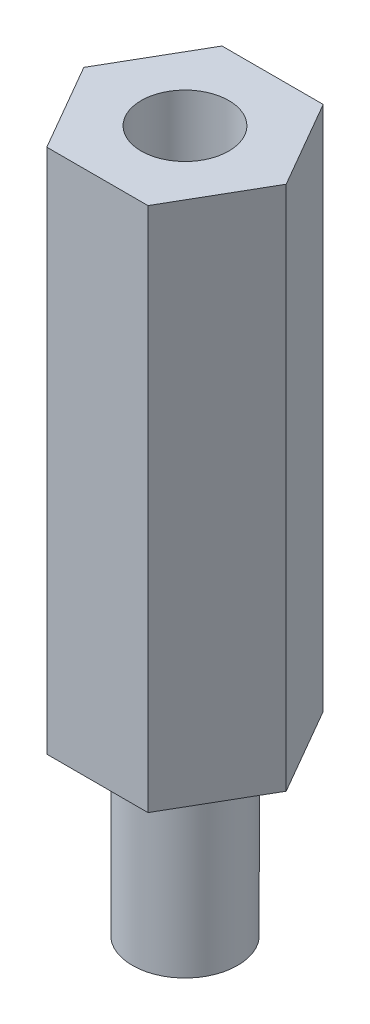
ISO-10303-21;
HEADER;
FILE_DESCRIPTION(('STEP AP214'),'2;1');
FILE_NAME('part.step','',(''),(''),'','','');
FILE_SCHEMA(('AUTOMOTIVE_DESIGN { 1 0 10303 214 1 1 1 1 }'));
ENDSEC;
DATA;
#1=APPLICATION_CONTEXT('core data for automotive mechanical design processes');
#2=APPLICATION_PROTOCOL_DEFINITION('international standard','automotive_design',2000,#1);
#3=PRODUCT_CONTEXT('',#1,'mechanical');
#4=PRODUCT('Part','Part','',(#3));
#5=PRODUCT_RELATED_PRODUCT_CATEGORY('part','',(#4));
#6=PRODUCT_DEFINITION_FORMATION('','',#4);
#7=PRODUCT_DEFINITION_CONTEXT('part definition',#1,'design');
#8=PRODUCT_DEFINITION('design','',#6,#7);
#9=PRODUCT_DEFINITION_SHAPE('','',#8);
#10=(LENGTH_UNIT() NAMED_UNIT(*) SI_UNIT(.MILLI.,.METRE.));
#11=(NAMED_UNIT(*) PLANE_ANGLE_UNIT() SI_UNIT($,.RADIAN.));
#12=(NAMED_UNIT(*) SI_UNIT($,.STERADIAN.) SOLID_ANGLE_UNIT());
#13=UNCERTAINTY_MEASURE_WITH_UNIT(LENGTH_MEASURE(1.E-05),#10,'distance_accuracy_value','');
#14=(GEOMETRIC_REPRESENTATION_CONTEXT(3) GLOBAL_UNCERTAINTY_ASSIGNED_CONTEXT((#13)) GLOBAL_UNIT_ASSIGNED_CONTEXT((#10,
#11,#12)) REPRESENTATION_CONTEXT('',''));
#15=CARTESIAN_POINT('',(0.,0.,0.));
#16=DIRECTION('',(0.,0.,1.));
#17=DIRECTION('',(1.,0.,0.));
#18=AXIS2_PLACEMENT_3D('',#15,#16,#17);
#19=CARTESIAN_POINT('',(5.77350269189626,30.,0.));
#20=DIRECTION('',(-0.866025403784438,0.,0.5));
#21=DIRECTION('',(0.5,0.,0.866025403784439));
#22=AXIS2_PLACEMENT_3D('',#19,#20,#21);
#23=PLANE('',#22);
#24=DIRECTION('',(-0.5,0.,-0.866025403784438));
#25=VECTOR('',#24,1.);
#26=CARTESIAN_POINT('',(5.77350269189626,0.,0.));
#27=LINE('',#26,#25);
#28=CARTESIAN_POINT('',(5.77350269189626,0.,0.));
#29=VERTEX_POINT('',#28);
#30=CARTESIAN_POINT('',(2.88675134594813,0.,-5.));
#31=VERTEX_POINT('',#30);
#32=EDGE_CURVE('E121',#29,#31,#27,.T.);
#33=ORIENTED_EDGE('',*,*,#32,.T.);
#34=DIRECTION('',(0.,-1.,0.));
#35=VECTOR('',#34,1.);
#36=CARTESIAN_POINT('',(2.88675134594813,30.,-5.));
#37=LINE('',#36,#35);
#38=CARTESIAN_POINT('',(2.88675134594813,30.,-5.));
#39=VERTEX_POINT('',#38);
#40=EDGE_CURVE('E44',#39,#31,#37,.T.);
#41=ORIENTED_EDGE('',*,*,#40,.F.);
#42=DIRECTION('',(-0.5,0.,-0.866025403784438));
#43=VECTOR('',#42,1.);
#44=CARTESIAN_POINT('',(5.77350269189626,30.,0.));
#45=LINE('',#44,#43);
#46=CARTESIAN_POINT('',(5.77350269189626,30.,0.));
#47=VERTEX_POINT('',#46);
#48=EDGE_CURVE('E132',#47,#39,#45,.T.);
#49=ORIENTED_EDGE('',*,*,#48,.F.);
#50=DIRECTION('',(0.,-1.,0.));
#51=VECTOR('',#50,1.);
#52=CARTESIAN_POINT('',(5.77350269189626,30.,0.));
#53=LINE('',#52,#51);
#54=EDGE_CURVE('E117',#47,#29,#53,.T.);
#55=ORIENTED_EDGE('',*,*,#54,.T.);
#56=EDGE_LOOP('',(#33,#41,#49,#55));
#57=FACE_BOUND('',#56,.T.);
#58=ADVANCED_FACE('F36',(#57),#23,.F.);
#59=CARTESIAN_POINT('',(2.88675134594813,30.,-5.));
#60=DIRECTION('',(0.,0.,1.));
#61=DIRECTION('',(1.,0.,0.));
#62=AXIS2_PLACEMENT_3D('',#59,#60,#61);
#63=PLANE('',#62);
#64=DIRECTION('',(-1.,0.,0.));
#65=VECTOR('',#64,1.);
#66=CARTESIAN_POINT('',(2.88675134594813,0.,-5.));
#67=LINE('',#66,#65);
#68=CARTESIAN_POINT('',(-2.88675134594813,0.,-5.));
#69=VERTEX_POINT('',#68);
#70=EDGE_CURVE('E124',#31,#69,#67,.T.);
#71=ORIENTED_EDGE('',*,*,#70,.T.);
#72=DIRECTION('',(0.,-1.,0.));
#73=VECTOR('',#72,1.);
#74=CARTESIAN_POINT('',(-2.88675134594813,30.,-5.));
#75=LINE('',#74,#73);
#76=CARTESIAN_POINT('',(-2.88675134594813,30.,-5.));
#77=VERTEX_POINT('',#76);
#78=EDGE_CURVE('E136',#77,#69,#75,.T.);
#79=ORIENTED_EDGE('',*,*,#78,.F.);
#80=DIRECTION('',(-1.,0.,0.));
#81=VECTOR('',#80,1.);
#82=CARTESIAN_POINT('',(2.88675134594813,30.,-5.));
#83=LINE('',#82,#81);
#84=EDGE_CURVE('E90',#39,#77,#83,.T.);
#85=ORIENTED_EDGE('',*,*,#84,.F.);
#86=ORIENTED_EDGE('',*,*,#40,.T.);
#87=EDGE_LOOP('',(#71,#79,#85,#86));
#88=FACE_BOUND('',#87,.T.);
#89=ADVANCED_FACE('F139',(#88),#63,.F.);
#90=CARTESIAN_POINT('',(-2.88675134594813,30.,-5.));
#91=DIRECTION('',(0.866025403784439,0.,0.5));
#92=DIRECTION('',(0.5,0.,-0.866025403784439));
#93=AXIS2_PLACEMENT_3D('',#90,#91,#92);
#94=PLANE('',#93);
#95=DIRECTION('',(-0.5,0.,0.866025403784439));
#96=VECTOR('',#95,1.);
#97=CARTESIAN_POINT('',(-2.88675134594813,0.,-5.));
#98=LINE('',#97,#96);
#99=CARTESIAN_POINT('',(-5.77350269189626,0.,0.));
#100=VERTEX_POINT('',#99);
#101=EDGE_CURVE('E127',#69,#100,#98,.T.);
#102=ORIENTED_EDGE('',*,*,#101,.T.);
#103=DIRECTION('',(0.,-1.,0.));
#104=VECTOR('',#103,1.);
#105=CARTESIAN_POINT('',(-5.77350269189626,30.,0.));
#106=LINE('',#105,#104);
#107=CARTESIAN_POINT('',(-5.77350269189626,30.,0.));
#108=VERTEX_POINT('',#107);
#109=EDGE_CURVE('E112',#108,#100,#106,.T.);
#110=ORIENTED_EDGE('',*,*,#109,.F.);
#111=DIRECTION('',(-0.5,0.,0.866025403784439));
#112=VECTOR('',#111,1.);
#113=CARTESIAN_POINT('',(-2.88675134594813,30.,-5.));
#114=LINE('',#113,#112);
#115=EDGE_CURVE('E103',#77,#108,#114,.T.);
#116=ORIENTED_EDGE('',*,*,#115,.F.);
#117=ORIENTED_EDGE('',*,*,#78,.T.);
#118=EDGE_LOOP('',(#102,#110,#116,#117));
#119=FACE_BOUND('',#118,.T.);
#120=ADVANCED_FACE('F147',(#119),#94,.F.);
#121=CARTESIAN_POINT('',(-5.77350269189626,30.,0.));
#122=DIRECTION('',(0.866025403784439,0.,-0.5));
#123=DIRECTION('',(-0.5,0.,-0.866025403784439));
#124=AXIS2_PLACEMENT_3D('',#121,#122,#123);
#125=PLANE('',#124);
#126=DIRECTION('',(0.5,0.,0.866025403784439));
#127=VECTOR('',#126,1.);
#128=CARTESIAN_POINT('',(-5.77350269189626,0.,0.));
#129=LINE('',#128,#127);
#130=CARTESIAN_POINT('',(-2.88675134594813,0.,5.));
#131=VERTEX_POINT('',#130);
#132=EDGE_CURVE('E111',#100,#131,#129,.T.);
#133=ORIENTED_EDGE('',*,*,#132,.T.);
#134=DIRECTION('',(0.,-1.,0.));
#135=VECTOR('',#134,1.);
#136=CARTESIAN_POINT('',(-2.88675134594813,30.,5.));
#137=LINE('',#136,#135);
#138=CARTESIAN_POINT('',(-2.88675134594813,30.,5.));
#139=VERTEX_POINT('',#138);
#140=EDGE_CURVE('E108',#139,#131,#137,.T.);
#141=ORIENTED_EDGE('',*,*,#140,.F.);
#142=DIRECTION('',(0.5,0.,0.866025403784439));
#143=VECTOR('',#142,1.);
#144=CARTESIAN_POINT('',(-5.77350269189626,30.,0.));
#145=LINE('',#144,#143);
#146=EDGE_CURVE('E97',#108,#139,#145,.T.);
#147=ORIENTED_EDGE('',*,*,#146,.F.);
#148=ORIENTED_EDGE('',*,*,#109,.T.);
#149=EDGE_LOOP('',(#133,#141,#147,#148));
#150=FACE_BOUND('',#149,.T.);
#151=ADVANCED_FACE('F109',(#150),#125,.F.);
#152=CARTESIAN_POINT('',(-2.88675134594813,30.,5.));
#153=DIRECTION('',(0.,0.,-1.));
#154=DIRECTION('',(-1.,0.,0.));
#155=AXIS2_PLACEMENT_3D('',#152,#153,#154);
#156=PLANE('',#155);
#157=DIRECTION('',(1.,0.,0.));
#158=VECTOR('',#157,1.);
#159=CARTESIAN_POINT('',(-2.88675134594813,0.,5.));
#160=LINE('',#159,#158);
#161=CARTESIAN_POINT('',(2.88675134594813,0.,5.));
#162=VERTEX_POINT('',#161);
#163=EDGE_CURVE('E75',#131,#162,#160,.T.);
#164=ORIENTED_EDGE('',*,*,#163,.T.);
#165=DIRECTION('',(0.,-1.,0.));
#166=VECTOR('',#165,1.);
#167=CARTESIAN_POINT('',(2.88675134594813,30.,5.));
#168=LINE('',#167,#166);
#169=CARTESIAN_POINT('',(2.88675134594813,30.,5.));
#170=VERTEX_POINT('',#169);
#171=EDGE_CURVE('E113',#170,#162,#168,.T.);
#172=ORIENTED_EDGE('',*,*,#171,.F.);
#173=DIRECTION('',(1.,0.,0.));
#174=VECTOR('',#173,1.);
#175=CARTESIAN_POINT('',(-2.88675134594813,30.,5.));
#176=LINE('',#175,#174);
#177=EDGE_CURVE('E101',#139,#170,#176,.T.);
#178=ORIENTED_EDGE('',*,*,#177,.F.);
#179=ORIENTED_EDGE('',*,*,#140,.T.);
#180=EDGE_LOOP('',(#164,#172,#178,#179));
#181=FACE_BOUND('',#180,.T.);
#182=ADVANCED_FACE('F115',(#181),#156,.F.);
#183=CARTESIAN_POINT('',(2.88675134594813,30.,5.));
#184=DIRECTION('',(-0.866025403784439,0.,-0.5));
#185=DIRECTION('',(-0.5,0.,0.866025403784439));
#186=AXIS2_PLACEMENT_3D('',#183,#184,#185);
#187=PLANE('',#186);
#188=DIRECTION('',(0.5,0.,-0.866025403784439));
#189=VECTOR('',#188,1.);
#190=CARTESIAN_POINT('',(2.88675134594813,0.,5.));
#191=LINE('',#190,#189);
#192=EDGE_CURVE('E81',#162,#29,#191,.T.);
#193=ORIENTED_EDGE('',*,*,#192,.T.);
#194=ORIENTED_EDGE('',*,*,#54,.F.);
#195=DIRECTION('',(0.5,0.,-0.866025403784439));
#196=VECTOR('',#195,1.);
#197=CARTESIAN_POINT('',(2.88675134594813,30.,5.));
#198=LINE('',#197,#196);
#199=EDGE_CURVE('E52',#170,#47,#198,.T.);
#200=ORIENTED_EDGE('',*,*,#199,.F.);
#201=ORIENTED_EDGE('',*,*,#171,.T.);
#202=EDGE_LOOP('',(#193,#194,#200,#201));
#203=FACE_BOUND('',#202,.T.);
#204=ADVANCED_FACE('F170',(#203),#187,.F.);
#205=CARTESIAN_POINT('',(0.,30.,0.));
#206=DIRECTION('',(0.,1.,0.));
#207=DIRECTION('',(0.,0.,1.));
#208=AXIS2_PLACEMENT_3D('',#205,#206,#207);
#209=PLANE('',#208);
#210=CARTESIAN_POINT('',(0.,30.,0.));
#211=DIRECTION('',(0.,1.,0.));
#212=DIRECTION('',(0.,0.,1.));
#213=AXIS2_PLACEMENT_3D('',#210,#211,#212);
#214=CIRCLE('',#213,2.5);
#215=CARTESIAN_POINT('',(0.,30.,2.5));
#216=VERTEX_POINT('',#215);
#217=EDGE_CURVE('E154',#216,#216,#214,.T.);
#218=ORIENTED_EDGE('',*,*,#217,.F.);
#219=EDGE_LOOP('',(#218));
#220=FACE_BOUND('',#219,.T.);
#221=ORIENTED_EDGE('',*,*,#48,.T.);
#222=ORIENTED_EDGE('',*,*,#84,.T.);
#223=ORIENTED_EDGE('',*,*,#115,.T.);
#224=ORIENTED_EDGE('',*,*,#146,.T.);
#225=ORIENTED_EDGE('',*,*,#177,.T.);
#226=ORIENTED_EDGE('',*,*,#199,.T.);
#227=EDGE_LOOP('',(#221,#222,#223,#224,#225,#226));
#228=FACE_BOUND('',#227,.T.);
#229=ADVANCED_FACE('F99',(#220,#228),#209,.T.);
#230=CARTESIAN_POINT('',(0.,0.,0.));
#231=DIRECTION('',(0.,1.,0.));
#232=DIRECTION('',(0.,0.,1.));
#233=AXIS2_PLACEMENT_3D('',#230,#231,#232);
#234=PLANE('',#233);
#235=CARTESIAN_POINT('',(0.,0.,0.));
#236=DIRECTION('',(0.,1.,0.));
#237=DIRECTION('',(0.,0.,1.));
#238=AXIS2_PLACEMENT_3D('',#235,#236,#237);
#239=CIRCLE('',#238,3.);
#240=CARTESIAN_POINT('',(0.,0.,3.));
#241=VERTEX_POINT('',#240);
#242=EDGE_CURVE('E11',#241,#241,#239,.F.);
#243=ORIENTED_EDGE('',*,*,#242,.F.);
#244=EDGE_LOOP('',(#243));
#245=FACE_BOUND('',#244,.T.);
#246=ORIENTED_EDGE('',*,*,#32,.F.);
#247=ORIENTED_EDGE('',*,*,#192,.F.);
#248=ORIENTED_EDGE('',*,*,#163,.F.);
#249=ORIENTED_EDGE('',*,*,#132,.F.);
#250=ORIENTED_EDGE('',*,*,#101,.F.);
#251=ORIENTED_EDGE('',*,*,#70,.F.);
#252=EDGE_LOOP('',(#246,#247,#248,#249,#250,#251));
#253=FACE_BOUND('',#252,.T.);
#254=ADVANCED_FACE('F144',(#245,#253),#234,.F.);
#255=CARTESIAN_POINT('',(0.,-10.,0.));
#256=DIRECTION('',(0.,1.,0.));
#257=DIRECTION('',(0.,0.,1.));
#258=AXIS2_PLACEMENT_3D('',#255,#256,#257);
#259=CYLINDRICAL_SURFACE('',#258,3.);
#260=CARTESIAN_POINT('',(0.,-10.,0.));
#261=DIRECTION('',(0.,-1.,0.));
#262=DIRECTION('',(0.,0.,-1.));
#263=AXIS2_PLACEMENT_3D('',#260,#261,#262);
#264=CIRCLE('',#263,3.);
#265=CARTESIAN_POINT('',(0.,-10.,-3.));
#266=VERTEX_POINT('',#265);
#267=EDGE_CURVE('E125',#266,#266,#264,.T.);
#268=ORIENTED_EDGE('',*,*,#267,.F.);
#269=EDGE_LOOP('',(#268));
#270=FACE_BOUND('',#269,.T.);
#271=ORIENTED_EDGE('',*,*,#242,.T.);
#272=EDGE_LOOP('',(#271));
#273=FACE_BOUND('',#272,.T.);
#274=ADVANCED_FACE('F176',(#270,#273),#259,.T.);
#275=CARTESIAN_POINT('',(0.,-10.,0.));
#276=DIRECTION('',(0.,-1.,0.));
#277=DIRECTION('',(0.,0.,-1.));
#278=AXIS2_PLACEMENT_3D('',#275,#276,#277);
#279=PLANE('',#278);
#280=ORIENTED_EDGE('',*,*,#267,.T.);
#281=EDGE_LOOP('',(#280));
#282=FACE_BOUND('',#281,.T.);
#283=ADVANCED_FACE('F165',(#282),#279,.T.);
#284=CARTESIAN_POINT('',(0.,19.,0.));
#285=DIRECTION('',(0.,1.,0.));
#286=DIRECTION('',(0.,0.,1.));
#287=AXIS2_PLACEMENT_3D('',#284,#285,#286);
#288=CYLINDRICAL_SURFACE('',#287,2.5);
#289=CARTESIAN_POINT('',(0.,19.,0.));
#290=DIRECTION('',(0.,1.,0.));
#291=DIRECTION('',(0.,0.,1.));
#292=AXIS2_PLACEMENT_3D('',#289,#290,#291);
#293=CIRCLE('',#292,2.5);
#294=CARTESIAN_POINT('',(0.,19.,2.5));
#295=VERTEX_POINT('',#294);
#296=EDGE_CURVE('E153',#295,#295,#293,.T.);
#297=ORIENTED_EDGE('',*,*,#296,.F.);
#298=EDGE_LOOP('',(#297));
#299=FACE_BOUND('',#298,.T.);
#300=ORIENTED_EDGE('',*,*,#217,.T.);
#301=EDGE_LOOP('',(#300));
#302=FACE_BOUND('',#301,.T.);
#303=ADVANCED_FACE('F162',(#299,#302),#288,.F.);
#304=CARTESIAN_POINT('',(0.,19.,0.));
#305=DIRECTION('',(0.,1.,0.));
#306=DIRECTION('',(0.,0.,1.));
#307=AXIS2_PLACEMENT_3D('',#304,#305,#306);
#308=PLANE('',#307);
#309=ORIENTED_EDGE('',*,*,#296,.T.);
#310=EDGE_LOOP('',(#309));
#311=FACE_BOUND('',#310,.T.);
#312=ADVANCED_FACE('F160',(#311),#308,.T.);
#313=CLOSED_SHELL('',(#58,#89,#120,#151,#182,#204,#229,#254,#274,#283,#303,#312));
#314=MANIFOLD_SOLID_BREP('B2',#313);
#315=ADVANCED_BREP_SHAPE_REPRESENTATION('',(#18,#314),#14);
#316=SHAPE_DEFINITION_REPRESENTATION(#9,#315);
ENDSEC;
END-ISO-10303-21;
